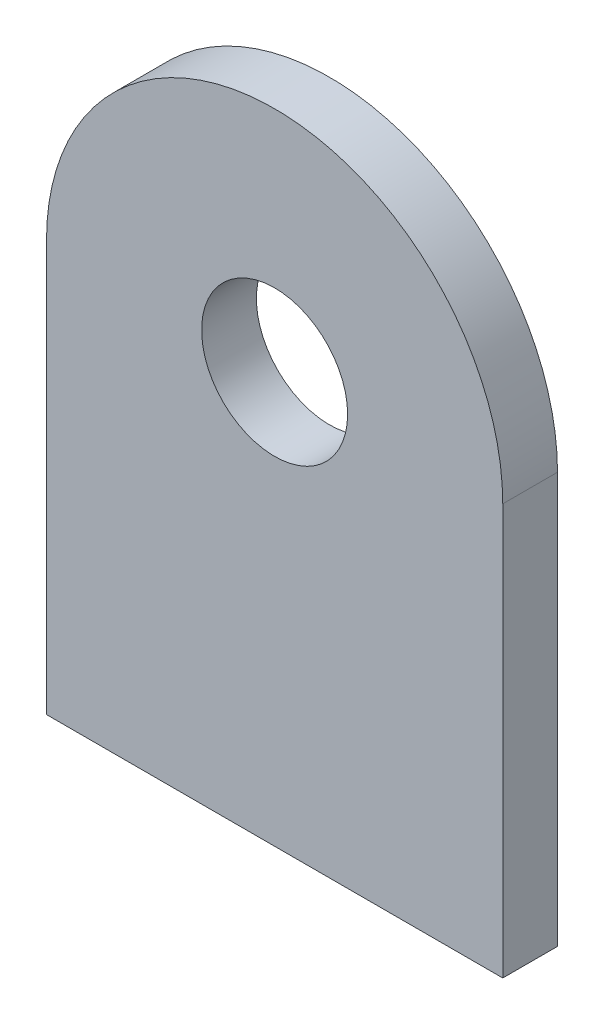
from build123d import *

# Parameters (mm, degrees)
BOSS_EXTRU_1_DEPTH      = 3
ESQUISSE4_R             = 4
ENL_V_MAT_EXTRU_1_DEPTH = 38.286056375


with BuildPart() as part:
    # Esquisse1 → Boss.-Extru.1 (new body)
    with BuildSketch(Plane.XY):
        with BuildLine():
            Line((-12.5, 0), (12.5, 0))
            Line((12.5, 0), (12.5, 22.5))
            ThreePointArc((12.5, 22.5), (0, 35), (-12.5, 22.5))
            Line((-12.5, 22.5), (-12.5, 0))
        make_face()
    extrude(amount=BOSS_EXTRU_1_DEPTH)

    # Esquisse4 → Enl_v. mat.-Extru.1 (cut, through all)
    with BuildSketch(Plane.XY.offset(3)):
        with Locations((0, 22.5)):
            Circle(ESQUISSE4_R)
    extrude(amount=-ENL_V_MAT_EXTRU_1_DEPTH, mode=Mode.SUBTRACT)


solid = part.part
